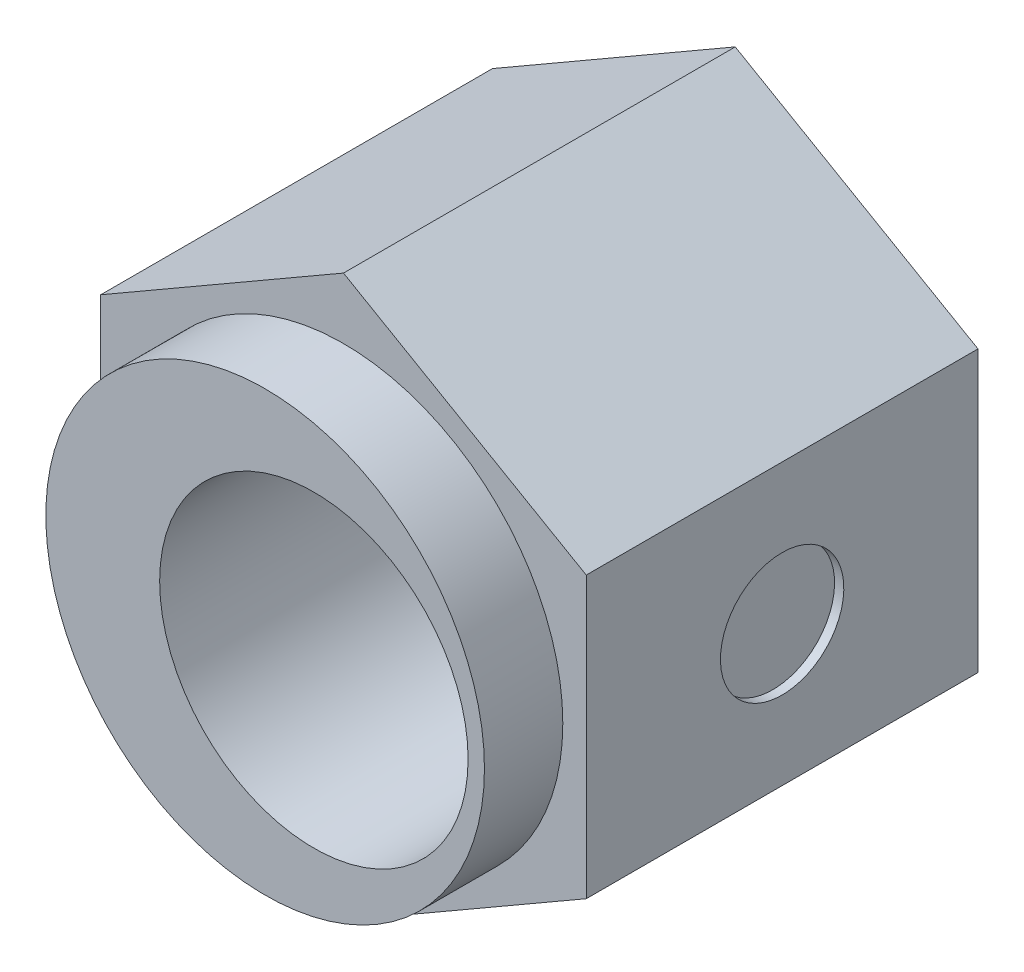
from build123d import *

# Parameters (mm, degrees)
SKETCH1_R        = 2.5
EXTRUSION1_DEPTH = 6.35
SKETCH2_R        = 3.555
SKETCH2_R_2      = 2.5
EXTRUSION2_DEPTH = 1.27
SKETCH3_R        = 1
EXTRUSION3_DEPTH = 0.15


with BuildPart() as part:
    # Sketch1 → Extrusion1 (new body)
    with BuildSketch(Plane.XY):
        Polygon((3.935, 2.271873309), (3.935, -2.271873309), (0, -4.543746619), (-3.935, -2.271873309), (-3.935, 2.271873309), (0, 4.543746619), align=None)
        with Locations(Location((0.79, 0, 0), (0, 0, 180))):
            Circle(SKETCH1_R, mode=Mode.SUBTRACT)
    extrude(amount=EXTRUSION1_DEPTH)

    # Sketch2 → Extrusion2 (add)
    with BuildSketch(Plane.XY.offset(6.35)):
        Circle(SKETCH2_R)
        with Locations(Location((0.79, 0, 0), (0, 0, 180))):
            Circle(SKETCH2_R_2, mode=Mode.SUBTRACT)
    extrude(amount=EXTRUSION2_DEPTH)

    # Sketch3 → Extrusion3 (cut)
    with BuildSketch(Plane(origin=(3.935, 0, 0), x_dir=(0, 0, -1), z_dir=(1, 0, 0))):
        with Locations(Location((-3.175, 0, 0), (0, 0, 90))):
            Circle(SKETCH3_R)
    extrude(amount=-EXTRUSION3_DEPTH, mode=Mode.SUBTRACT)


solid = part.part
